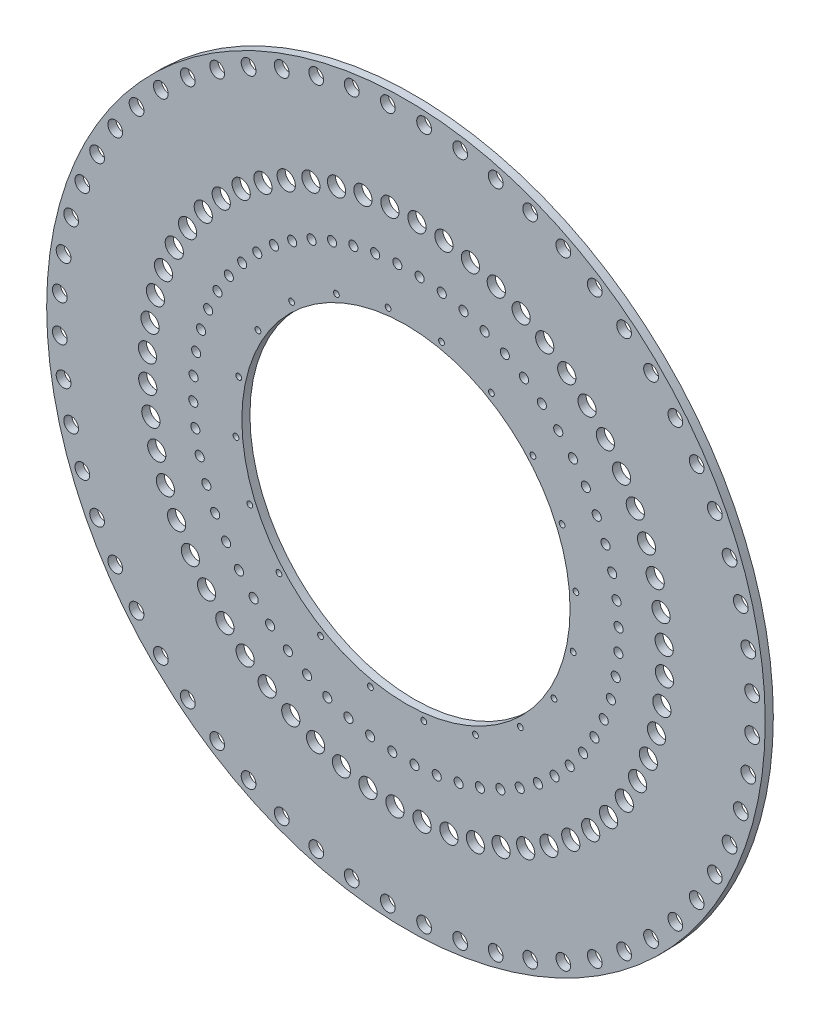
from build123d import *

# Parameters (mm, degrees)
SKETCH1_R                                      = 140.97
SKETCH1_R_2                                    = 64.389
BOSS_EXTRUDE1_DEPTH                            = 3.175
CSK_FOR_2_FLAT_HEAD_MACHINE_SCREW1_D           = 2.2606
CSK_FOR_2_FLAT_HEAD_MACHINE_SCREW1_CSINK_D     = 4.3688
CSK_FOR_2_FLAT_HEAD_MACHINE_SCREW1_CSINK_ANGLE = 82
CSK_FOR_2_FLAT_HEAD_MACHINE_SCREW3_D           = 2.2606
CSK_FOR_2_FLAT_HEAD_MACHINE_SCREW3_CSINK_D     = 4.3688
CSK_FOR_2_FLAT_HEAD_MACHINE_SCREW3_CSINK_ANGLE = 82
CIRPATTERN1_COUNT                              = 10
F_1_0_228_DIAMETER_HOLE1_D                     = 5.7912
F_9_32_0_28125_DIAMETER_HOLE1_D                = 7.14375
SKETCH8_R                                      = 1.78562
CUT_EXTRUDE1_DEPTH                             = 200.386966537
CIRPATTERN2_COUNT                              = 60


with BuildPart() as part:
    # Sketch1 → Boss-Extrude1 (new body)
    with BuildSketch(Plane.XY):
        Circle(SKETCH1_R)
        Circle(SKETCH1_R_2, mode=Mode.SUBTRACT)
    extrude(amount=BOSS_EXTRUDE1_DEPTH)

    # CSK for _2 Flat Head Machine Screw1 (through all)
    with Locations(Plane(origin=(0, 0, 0), x_dir=(-1, 0, 0), z_dir=(0, 0, -1))):
        with Locations((-13.941726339, 65.590665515)):
            csk_for_2_flat_head_machine_screw1 = CounterSinkHole(CSK_FOR_2_FLAT_HEAD_MACHINE_SCREW1_D / 2, CSK_FOR_2_FLAT_HEAD_MACHINE_SCREW1_CSINK_D / 2, counter_sink_angle=CSK_FOR_2_FLAT_HEAD_MACHINE_SCREW1_CSINK_ANGLE)

    # CSK for _2 Flat Head Machine Screw3 (through all)
    with Locations(Plane(origin=(0, 0, 0), x_dir=(-1, 0, 0), z_dir=(0, 0, -1))):
        with Locations((-33.528, 58.072199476)):
            csk_for_2_flat_head_machine_screw3 = CounterSinkHole(CSK_FOR_2_FLAT_HEAD_MACHINE_SCREW3_D / 2, CSK_FOR_2_FLAT_HEAD_MACHINE_SCREW3_CSINK_D / 2, counter_sink_angle=CSK_FOR_2_FLAT_HEAD_MACHINE_SCREW3_CSINK_ANGLE)

    # CirPattern1: CSK for _2 Flat Head Machine Screw1, CSK for _2 Flat Head Machine Screw3 ×10 about axis
    cirpattern1_axis = Axis((0, 0, 0), (0, 0, 1))
    add([csk_for_2_flat_head_machine_screw1.rotate(cirpattern1_axis, i * 360 / CIRPATTERN1_COUNT) for i in range(1, CIRPATTERN1_COUNT)], mode=Mode.SUBTRACT)
    add([csk_for_2_flat_head_machine_screw3.rotate(cirpattern1_axis, i * 360 / CIRPATTERN1_COUNT) for i in range(1, CIRPATTERN1_COUNT)], mode=Mode.SUBTRACT)

    # 1 _0.228_ Diameter Hole1 (through all)
    with Locations(Plane(origin=(0, 0, 0), x_dir=(-1, 0, 0), z_dir=(0, 0, -1))):
        with Locations((-7.117690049, 135.813616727)):
            f_1_0_228_diameter_hole1 = Hole(F_1_0_228_DIAMETER_HOLE1_D / 2)

    # 9_32 _0.28125_ Diameter Hole1 (through all)
    with Locations(Plane(origin=(0, 0, 0), x_dir=(-1, 0, 0), z_dir=(0, 0, -1))):
        with Locations((-4.313470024, 101.413233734)):
            f_9_32_0_28125_diameter_hole1 = Hole(F_9_32_0_28125_DIAMETER_HOLE1_D / 2)

    # Sketch8 → Cut-Extrude1 (cut, through all)
    with BuildSketch(Plane(origin=(0, 0, 0), x_dir=(-1, 0, 0), z_dir=(0, 0, -1))):
        with Locations((-5.368681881, 83.333230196)):
            Circle(SKETCH8_R)
    cut_extrude1 = extrude(amount=-CUT_EXTRUDE1_DEPTH, mode=Mode.SUBTRACT)

    # CirPattern2: 1 _0.228_ Diameter Hole1, 9_32 _0.28125_ Diameter Hole1, Cut-Extrude1 ×60 about axis
    cirpattern2_axis = Axis((0, 0, 0), (0, 0, 1))
    add([f_1_0_228_diameter_hole1.rotate(cirpattern2_axis, i * 360 / CIRPATTERN2_COUNT) for i in range(1, CIRPATTERN2_COUNT)], mode=Mode.SUBTRACT)
    add([f_9_32_0_28125_diameter_hole1.rotate(cirpattern2_axis, i * 360 / CIRPATTERN2_COUNT) for i in range(1, CIRPATTERN2_COUNT)], mode=Mode.SUBTRACT)
    add([cut_extrude1.rotate(cirpattern2_axis, i * 360 / CIRPATTERN2_COUNT) for i in range(1, CIRPATTERN2_COUNT)], mode=Mode.SUBTRACT)


solid = part.part
